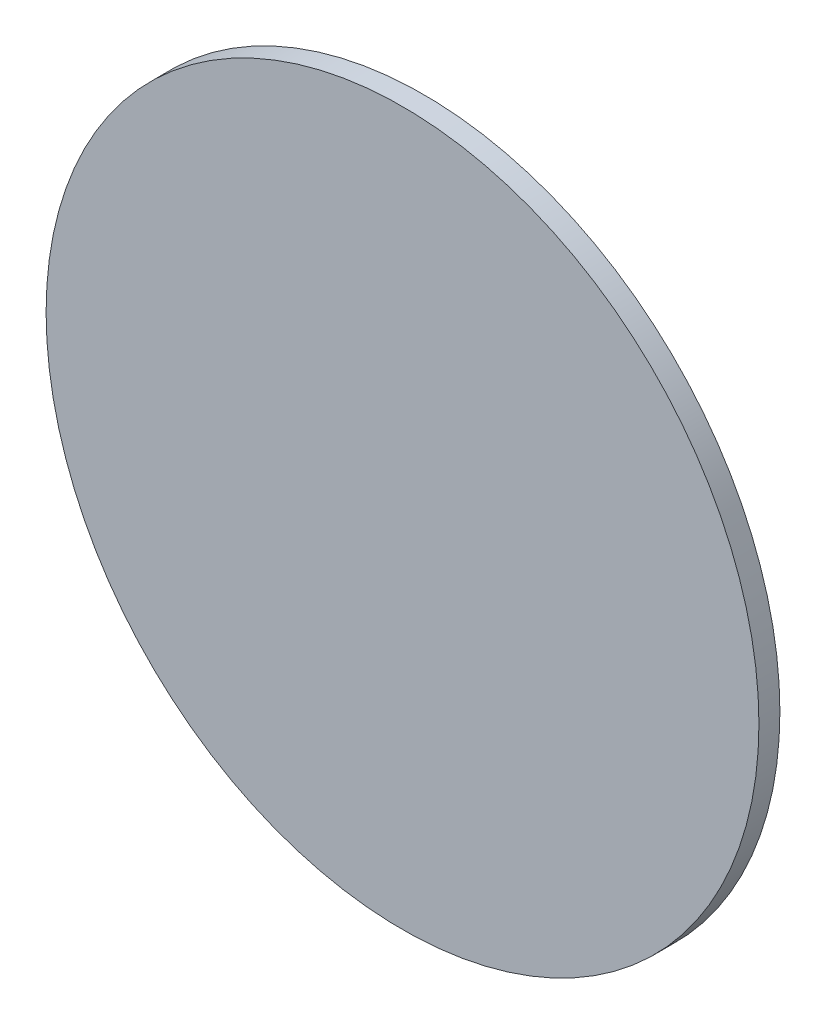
ISO-10303-21;
HEADER;
FILE_DESCRIPTION(('STEP AP214'),'2;1');
FILE_NAME('part.step','',(''),(''),'','','');
FILE_SCHEMA(('AUTOMOTIVE_DESIGN { 1 0 10303 214 1 1 1 1 }'));
ENDSEC;
DATA;
#1=APPLICATION_CONTEXT('core data for automotive mechanical design processes');
#2=APPLICATION_PROTOCOL_DEFINITION('international standard','automotive_design',2000,#1);
#3=PRODUCT_CONTEXT('',#1,'mechanical');
#4=PRODUCT('Part','Part','',(#3));
#5=PRODUCT_RELATED_PRODUCT_CATEGORY('part','',(#4));
#6=PRODUCT_DEFINITION_FORMATION('','',#4);
#7=PRODUCT_DEFINITION_CONTEXT('part definition',#1,'design');
#8=PRODUCT_DEFINITION('design','',#6,#7);
#9=PRODUCT_DEFINITION_SHAPE('','',#8);
#10=(LENGTH_UNIT() NAMED_UNIT(*) SI_UNIT(.MILLI.,.METRE.));
#11=(NAMED_UNIT(*) PLANE_ANGLE_UNIT() SI_UNIT($,.RADIAN.));
#12=(NAMED_UNIT(*) SI_UNIT($,.STERADIAN.) SOLID_ANGLE_UNIT());
#13=UNCERTAINTY_MEASURE_WITH_UNIT(LENGTH_MEASURE(1.E-05),#10,'distance_accuracy_value','');
#14=(GEOMETRIC_REPRESENTATION_CONTEXT(3) GLOBAL_UNCERTAINTY_ASSIGNED_CONTEXT((#13)) GLOBAL_UNIT_ASSIGNED_CONTEXT((#10,
#11,#12)) REPRESENTATION_CONTEXT('',''));
#15=CARTESIAN_POINT('',(0.,0.,0.));
#16=DIRECTION('',(0.,0.,1.));
#17=DIRECTION('',(1.,0.,0.));
#18=AXIS2_PLACEMENT_3D('',#15,#16,#17);
#19=CARTESIAN_POINT('',(0.,0.,0.0999999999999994));
#20=DIRECTION('',(0.,0.,-1.));
#21=DIRECTION('',(-1.,0.,0.));
#22=AXIS2_PLACEMENT_3D('',#19,#20,#21);
#23=CYLINDRICAL_SURFACE('',#22,1.7);
#24=CARTESIAN_POINT('',(0.,0.,0.0999999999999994));
#25=DIRECTION('',(0.,0.,1.));
#26=DIRECTION('',(1.,0.,0.));
#27=AXIS2_PLACEMENT_3D('',#24,#25,#26);
#28=CIRCLE('',#27,1.7);
#29=CARTESIAN_POINT('',(1.7,0.,0.0999999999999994));
#30=VERTEX_POINT('',#29);
#31=EDGE_CURVE('E10',#30,#30,#28,.T.);
#32=ORIENTED_EDGE('',*,*,#31,.F.);
#33=EDGE_LOOP('',(#32));
#34=FACE_BOUND('',#33,.T.);
#35=CARTESIAN_POINT('',(0.,0.,0.));
#36=DIRECTION('',(0.,0.,1.));
#37=DIRECTION('',(1.,0.,0.));
#38=AXIS2_PLACEMENT_3D('',#35,#36,#37);
#39=CIRCLE('',#38,1.7);
#40=CARTESIAN_POINT('',(1.7,0.,0.));
#41=VERTEX_POINT('',#40);
#42=EDGE_CURVE('E33',#41,#41,#39,.T.);
#43=ORIENTED_EDGE('',*,*,#42,.T.);
#44=EDGE_LOOP('',(#43));
#45=FACE_BOUND('',#44,.T.);
#46=ADVANCED_FACE('F27',(#34,#45),#23,.T.);
#47=CARTESIAN_POINT('',(0.,0.,0.0999999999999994));
#48=DIRECTION('',(0.,0.,1.));
#49=DIRECTION('',(1.,0.,0.));
#50=AXIS2_PLACEMENT_3D('',#47,#48,#49);
#51=PLANE('',#50);
#52=ORIENTED_EDGE('',*,*,#31,.T.);
#53=EDGE_LOOP('',(#52));
#54=FACE_BOUND('',#53,.T.);
#55=ADVANCED_FACE('F42',(#54),#51,.T.);
#56=CARTESIAN_POINT('',(0.,0.,0.));
#57=DIRECTION('',(0.,0.,1.));
#58=DIRECTION('',(1.,0.,0.));
#59=AXIS2_PLACEMENT_3D('',#56,#57,#58);
#60=PLANE('',#59);
#61=ORIENTED_EDGE('',*,*,#42,.F.);
#62=EDGE_LOOP('',(#61));
#63=FACE_BOUND('',#62,.T.);
#64=ADVANCED_FACE('F40',(#63),#60,.F.);
#65=CLOSED_SHELL('',(#46,#55,#64));
#66=MANIFOLD_SOLID_BREP('B2',#65);
#67=ADVANCED_BREP_SHAPE_REPRESENTATION('',(#18,#66),#14);
#68=SHAPE_DEFINITION_REPRESENTATION(#9,#67);
ENDSEC;
END-ISO-10303-21;
